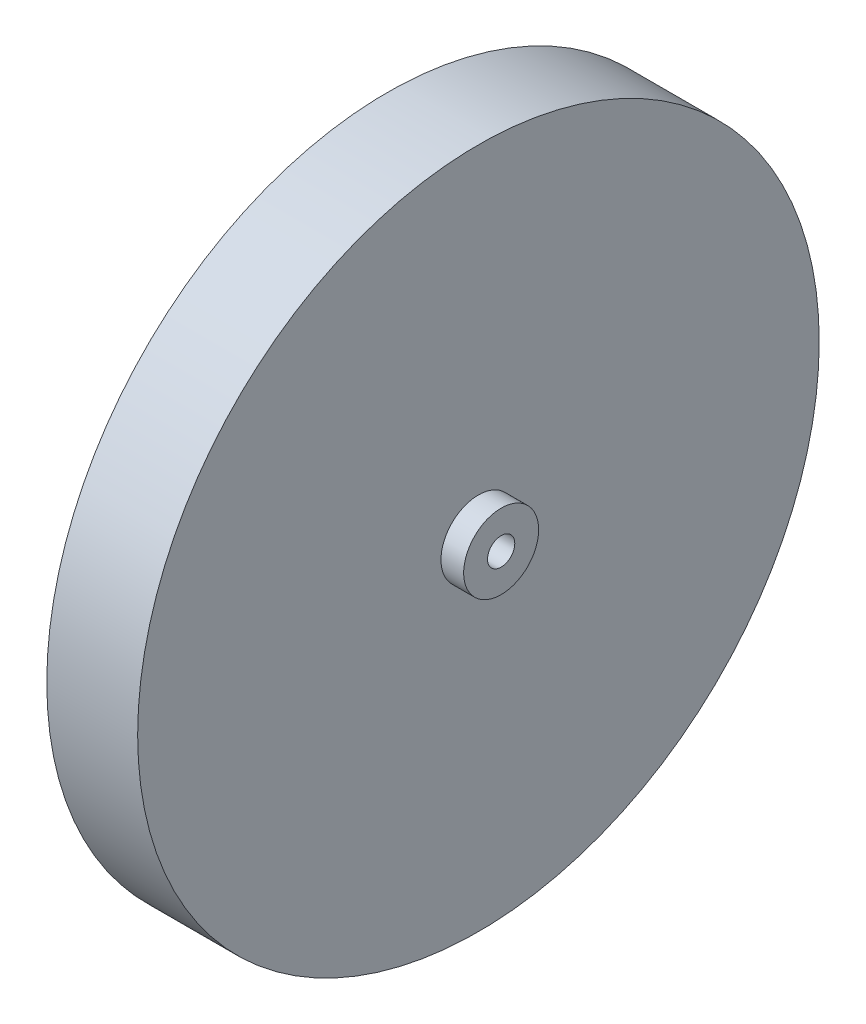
ISO-10303-21;
HEADER;
FILE_DESCRIPTION(('STEP AP214'),'2;1');
FILE_NAME('part.step','',(''),(''),'','','');
FILE_SCHEMA(('AUTOMOTIVE_DESIGN { 1 0 10303 214 1 1 1 1 }'));
ENDSEC;
DATA;
#1=APPLICATION_CONTEXT('core data for automotive mechanical design processes');
#2=APPLICATION_PROTOCOL_DEFINITION('international standard','automotive_design',2000,#1);
#3=PRODUCT_CONTEXT('',#1,'mechanical');
#4=PRODUCT('Part','Part','',(#3));
#5=PRODUCT_RELATED_PRODUCT_CATEGORY('part','',(#4));
#6=PRODUCT_DEFINITION_FORMATION('','',#4);
#7=PRODUCT_DEFINITION_CONTEXT('part definition',#1,'design');
#8=PRODUCT_DEFINITION('design','',#6,#7);
#9=PRODUCT_DEFINITION_SHAPE('','',#8);
#10=(LENGTH_UNIT() NAMED_UNIT(*) SI_UNIT(.MILLI.,.METRE.));
#11=(NAMED_UNIT(*) PLANE_ANGLE_UNIT() SI_UNIT($,.RADIAN.));
#12=(NAMED_UNIT(*) SI_UNIT($,.STERADIAN.) SOLID_ANGLE_UNIT());
#13=UNCERTAINTY_MEASURE_WITH_UNIT(LENGTH_MEASURE(1.E-05),#10,'distance_accuracy_value','');
#14=(GEOMETRIC_REPRESENTATION_CONTEXT(3) GLOBAL_UNCERTAINTY_ASSIGNED_CONTEXT((#13)) GLOBAL_UNIT_ASSIGNED_CONTEXT((#10,
#11,#12)) REPRESENTATION_CONTEXT('',''));
#15=CARTESIAN_POINT('',(0.,0.,0.));
#16=DIRECTION('',(0.,0.,1.));
#17=DIRECTION('',(1.,0.,0.));
#18=AXIS2_PLACEMENT_3D('',#15,#16,#17);
#19=CARTESIAN_POINT('',(10.16,0.,0.));
#20=DIRECTION('',(1.,0.,0.));
#21=DIRECTION('',(0.,0.,-1.));
#22=AXIS2_PLACEMENT_3D('',#19,#20,#21);
#23=PLANE('',#22);
#24=CARTESIAN_POINT('',(10.16,0.,0.));
#25=DIRECTION('',(1.,0.,0.));
#26=DIRECTION('',(0.,0.,-1.));
#27=AXIS2_PLACEMENT_3D('',#24,#25,#26);
#28=CIRCLE('',#27,38.1);
#29=CARTESIAN_POINT('',(10.16,0.,-38.1));
#30=VERTEX_POINT('',#29);
#31=EDGE_CURVE('E10',#30,#30,#28,.T.);
#32=ORIENTED_EDGE('',*,*,#31,.T.);
#33=EDGE_LOOP('',(#32));
#34=FACE_BOUND('',#33,.T.);
#35=CARTESIAN_POINT('',(10.16,0.,0.));
#36=DIRECTION('',(1.,0.,0.));
#37=DIRECTION('',(0.,0.,-1.));
#38=AXIS2_PLACEMENT_3D('',#35,#36,#37);
#39=CIRCLE('',#38,4.191);
#40=CARTESIAN_POINT('',(10.16,0.,-4.191));
#41=VERTEX_POINT('',#40);
#42=EDGE_CURVE('E46',#41,#41,#39,.T.);
#43=ORIENTED_EDGE('',*,*,#42,.F.);
#44=EDGE_LOOP('',(#43));
#45=FACE_BOUND('',#44,.T.);
#46=ADVANCED_FACE('F33',(#34,#45),#23,.T.);
#47=CARTESIAN_POINT('',(10.16,0.,0.));
#48=DIRECTION('',(-1.,0.,0.));
#49=DIRECTION('',(0.,0.,1.));
#50=AXIS2_PLACEMENT_3D('',#47,#48,#49);
#51=CYLINDRICAL_SURFACE('',#50,38.1);
#52=ORIENTED_EDGE('',*,*,#31,.F.);
#53=EDGE_LOOP('',(#52));
#54=FACE_BOUND('',#53,.T.);
#55=CARTESIAN_POINT('',(0.,0.,0.));
#56=DIRECTION('',(1.,0.,0.));
#57=DIRECTION('',(0.,0.,-1.));
#58=AXIS2_PLACEMENT_3D('',#55,#56,#57);
#59=CIRCLE('',#58,38.1);
#60=CARTESIAN_POINT('',(0.,0.,-38.1));
#61=VERTEX_POINT('',#60);
#62=EDGE_CURVE('E37',#61,#61,#59,.T.);
#63=ORIENTED_EDGE('',*,*,#62,.T.);
#64=EDGE_LOOP('',(#63));
#65=FACE_BOUND('',#64,.T.);
#66=ADVANCED_FACE('F35',(#54,#65),#51,.T.);
#67=CARTESIAN_POINT('',(0.,0.,0.));
#68=DIRECTION('',(1.,0.,0.));
#69=DIRECTION('',(0.,0.,-1.));
#70=AXIS2_PLACEMENT_3D('',#67,#68,#69);
#71=PLANE('',#70);
#72=CARTESIAN_POINT('',(0.,0.,0.));
#73=DIRECTION('',(1.,0.,0.));
#74=DIRECTION('',(0.,0.,-1.));
#75=AXIS2_PLACEMENT_3D('',#72,#73,#74);
#76=CIRCLE('',#75,1.524);
#77=CARTESIAN_POINT('',(0.,0.,-1.524));
#78=VERTEX_POINT('',#77);
#79=EDGE_CURVE('E49',#78,#78,#76,.T.);
#80=ORIENTED_EDGE('',*,*,#79,.T.);
#81=EDGE_LOOP('',(#80));
#82=FACE_BOUND('',#81,.T.);
#83=ORIENTED_EDGE('',*,*,#62,.F.);
#84=EDGE_LOOP('',(#83));
#85=FACE_BOUND('',#84,.T.);
#86=ADVANCED_FACE('F58',(#82,#85),#71,.F.);
#87=CARTESIAN_POINT('',(12.7,0.,0.));
#88=DIRECTION('',(-1.,0.,0.));
#89=DIRECTION('',(0.,0.,1.));
#90=AXIS2_PLACEMENT_3D('',#87,#88,#89);
#91=CYLINDRICAL_SURFACE('',#90,4.191);
#92=CARTESIAN_POINT('',(12.7,0.,0.));
#93=DIRECTION('',(1.,0.,0.));
#94=DIRECTION('',(0.,0.,-1.));
#95=AXIS2_PLACEMENT_3D('',#92,#93,#94);
#96=CIRCLE('',#95,4.191);
#97=CARTESIAN_POINT('',(12.7,0.,-4.191));
#98=VERTEX_POINT('',#97);
#99=EDGE_CURVE('E44',#98,#98,#96,.T.);
#100=ORIENTED_EDGE('',*,*,#99,.F.);
#101=EDGE_LOOP('',(#100));
#102=FACE_BOUND('',#101,.T.);
#103=ORIENTED_EDGE('',*,*,#42,.T.);
#104=EDGE_LOOP('',(#103));
#105=FACE_BOUND('',#104,.T.);
#106=ADVANCED_FACE('F70',(#102,#105),#91,.T.);
#107=CARTESIAN_POINT('',(12.7,0.,0.));
#108=DIRECTION('',(1.,0.,0.));
#109=DIRECTION('',(0.,0.,-1.));
#110=AXIS2_PLACEMENT_3D('',#107,#108,#109);
#111=PLANE('',#110);
#112=CARTESIAN_POINT('',(12.7,0.,0.));
#113=DIRECTION('',(1.,0.,0.));
#114=DIRECTION('',(0.,0.,-1.));
#115=AXIS2_PLACEMENT_3D('',#112,#113,#114);
#116=CIRCLE('',#115,1.524);
#117=CARTESIAN_POINT('',(12.7,0.,-1.524));
#118=VERTEX_POINT('',#117);
#119=EDGE_CURVE('E52',#118,#118,#116,.T.);
#120=ORIENTED_EDGE('',*,*,#119,.F.);
#121=EDGE_LOOP('',(#120));
#122=FACE_BOUND('',#121,.T.);
#123=ORIENTED_EDGE('',*,*,#99,.T.);
#124=EDGE_LOOP('',(#123));
#125=FACE_BOUND('',#124,.T.);
#126=ADVANCED_FACE('F64',(#122,#125),#111,.T.);
#127=CARTESIAN_POINT('',(0.,0.,0.));
#128=DIRECTION('',(1.,0.,0.));
#129=DIRECTION('',(0.,0.,-1.));
#130=AXIS2_PLACEMENT_3D('',#127,#128,#129);
#131=CYLINDRICAL_SURFACE('',#130,1.524);
#132=CARTESIAN_POINT('',(0.,0.,-1.524));
#133=CARTESIAN_POINT('',(0.132291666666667,0.,-1.524));
#134=CARTESIAN_POINT('',(0.264583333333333,0.,-1.524));
#135=CARTESIAN_POINT('',(0.529166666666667,0.,-1.524));
#136=CARTESIAN_POINT('',(0.661458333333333,0.,-1.524));
#137=CARTESIAN_POINT('',(0.926041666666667,0.,-1.524));
#138=CARTESIAN_POINT('',(1.05833333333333,0.,-1.524));
#139=CARTESIAN_POINT('',(1.32291666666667,0.,-1.524));
#140=CARTESIAN_POINT('',(1.45520833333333,0.,-1.524));
#141=CARTESIAN_POINT('',(1.71979166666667,0.,-1.524));
#142=CARTESIAN_POINT('',(1.85208333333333,0.,-1.524));
#143=CARTESIAN_POINT('',(2.11666666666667,0.,-1.524));
#144=CARTESIAN_POINT('',(2.24895833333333,0.,-1.524));
#145=CARTESIAN_POINT('',(2.51354166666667,0.,-1.524));
#146=CARTESIAN_POINT('',(2.64583333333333,0.,-1.524));
#147=CARTESIAN_POINT('',(2.91041666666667,0.,-1.524));
#148=CARTESIAN_POINT('',(3.04270833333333,0.,-1.524));
#149=CARTESIAN_POINT('',(3.30729166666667,0.,-1.524));
#150=CARTESIAN_POINT('',(3.43958333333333,0.,-1.524));
#151=CARTESIAN_POINT('',(3.70416666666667,0.,-1.524));
#152=CARTESIAN_POINT('',(3.83645833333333,0.,-1.524));
#153=CARTESIAN_POINT('',(4.10104166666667,0.,-1.524));
#154=CARTESIAN_POINT('',(4.23333333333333,0.,-1.524));
#155=CARTESIAN_POINT('',(4.49791666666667,0.,-1.524));
#156=CARTESIAN_POINT('',(4.63020833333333,0.,-1.524));
#157=CARTESIAN_POINT('',(4.89479166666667,0.,-1.524));
#158=CARTESIAN_POINT('',(5.02708333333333,0.,-1.524));
#159=CARTESIAN_POINT('',(5.29166666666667,0.,-1.524));
#160=CARTESIAN_POINT('',(5.42395833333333,0.,-1.524));
#161=CARTESIAN_POINT('',(5.68854166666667,0.,-1.524));
#162=CARTESIAN_POINT('',(5.82083333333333,0.,-1.524));
#163=CARTESIAN_POINT('',(6.08541666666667,0.,-1.524));
#164=CARTESIAN_POINT('',(6.21770833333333,0.,-1.524));
#165=CARTESIAN_POINT('',(6.48229166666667,0.,-1.524));
#166=CARTESIAN_POINT('',(6.61458333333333,0.,-1.524));
#167=CARTESIAN_POINT('',(6.87916666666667,0.,-1.524));
#168=CARTESIAN_POINT('',(7.01145833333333,0.,-1.524));
#169=CARTESIAN_POINT('',(7.27604166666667,0.,-1.524));
#170=CARTESIAN_POINT('',(7.40833333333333,0.,-1.524));
#171=CARTESIAN_POINT('',(7.67291666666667,0.,-1.524));
#172=CARTESIAN_POINT('',(7.80520833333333,0.,-1.524));
#173=CARTESIAN_POINT('',(8.06979166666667,0.,-1.524));
#174=CARTESIAN_POINT('',(8.20208333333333,0.,-1.524));
#175=CARTESIAN_POINT('',(8.46666666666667,0.,-1.524));
#176=CARTESIAN_POINT('',(8.59895833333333,0.,-1.524));
#177=CARTESIAN_POINT('',(8.86354166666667,0.,-1.524));
#178=CARTESIAN_POINT('',(8.99583333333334,0.,-1.524));
#179=CARTESIAN_POINT('',(9.26041666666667,0.,-1.524));
#180=CARTESIAN_POINT('',(9.39270833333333,0.,-1.524));
#181=CARTESIAN_POINT('',(9.65729166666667,0.,-1.524));
#182=CARTESIAN_POINT('',(9.78958333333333,0.,-1.524));
#183=CARTESIAN_POINT('',(10.0541666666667,0.,-1.524));
#184=CARTESIAN_POINT('',(10.1864583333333,0.,-1.524));
#185=CARTESIAN_POINT('',(10.4510416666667,0.,-1.524));
#186=CARTESIAN_POINT('',(10.5833333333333,0.,-1.524));
#187=CARTESIAN_POINT('',(10.8479166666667,0.,-1.524));
#188=CARTESIAN_POINT('',(10.9802083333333,0.,-1.524));
#189=CARTESIAN_POINT('',(11.2447916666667,0.,-1.524));
#190=CARTESIAN_POINT('',(11.3770833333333,0.,-1.524));
#191=CARTESIAN_POINT('',(11.6416666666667,0.,-1.524));
#192=CARTESIAN_POINT('',(11.7739583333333,0.,-1.524));
#193=CARTESIAN_POINT('',(12.0385416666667,0.,-1.524));
#194=CARTESIAN_POINT('',(12.1708333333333,0.,-1.524));
#195=CARTESIAN_POINT('',(12.4354166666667,0.,-1.524));
#196=CARTESIAN_POINT('',(12.5677083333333,0.,-1.524));
#197=CARTESIAN_POINT('',(12.7,0.,-1.524));
#198=B_SPLINE_CURVE_WITH_KNOTS('',3,(#132,#133,#134,#135,#136,#137,#138,#139,#140,#141,#142,
#143,#144,#145,#146,#147,#148,#149,#150,#151,#152,#153,#154,#155,#156,#157,#158,#159,#160,#161,
#162,#163,#164,#165,#166,#167,#168,#169,#170,#171,#172,#173,#174,#175,#176,#177,#178,#179,#180,
#181,#182,#183,#184,#185,#186,#187,#188,#189,#190,#191,#192,#193,#194,#195,#196,#197),
.UNSPECIFIED.,.F.,.F.,(4,2,2,2,2,2,2,2,2,2,2,2,2,2,2,2,2,2,2,2,2,2,2,2,2,2,2,2,2,2,2,2,4),(0.,
0.396875,0.79375,1.190625,1.5875,1.984375,2.38125,2.778125,3.175,3.571875,3.96875,4.365625,
4.7625,5.159375,5.55625,5.953125,6.35,6.746875,7.14375,7.540625,7.9375,8.334375,8.73125,
9.128125,9.525,9.921875,10.31875,10.715625,11.1125,11.509375,11.90625,12.303125,12.7),.UNSPECIFIED.);
#199=EDGE_CURVE('BSEAM61',#78,#118,#198,.T.);
#200=ORIENTED_EDGE('',*,*,#79,.F.);
#201=ORIENTED_EDGE('',*,*,#119,.T.);
#202=ORIENTED_EDGE('',*,*,#199,.T.);
#203=ORIENTED_EDGE('',*,*,#199,.F.);
#204=EDGE_LOOP('',(#200,#202,#201,#203));
#205=FACE_BOUND('',#204,.T.);
#206=ADVANCED_FACE('F61',(#205),#131,.F.);
#207=CLOSED_SHELL('',(#46,#66,#86,#106,#126,#206));
#208=MANIFOLD_SOLID_BREP('B2',#207);
#209=ADVANCED_BREP_SHAPE_REPRESENTATION('',(#18,#208),#14);
#210=SHAPE_DEFINITION_REPRESENTATION(#9,#209);
ENDSEC;
END-ISO-10303-21;
